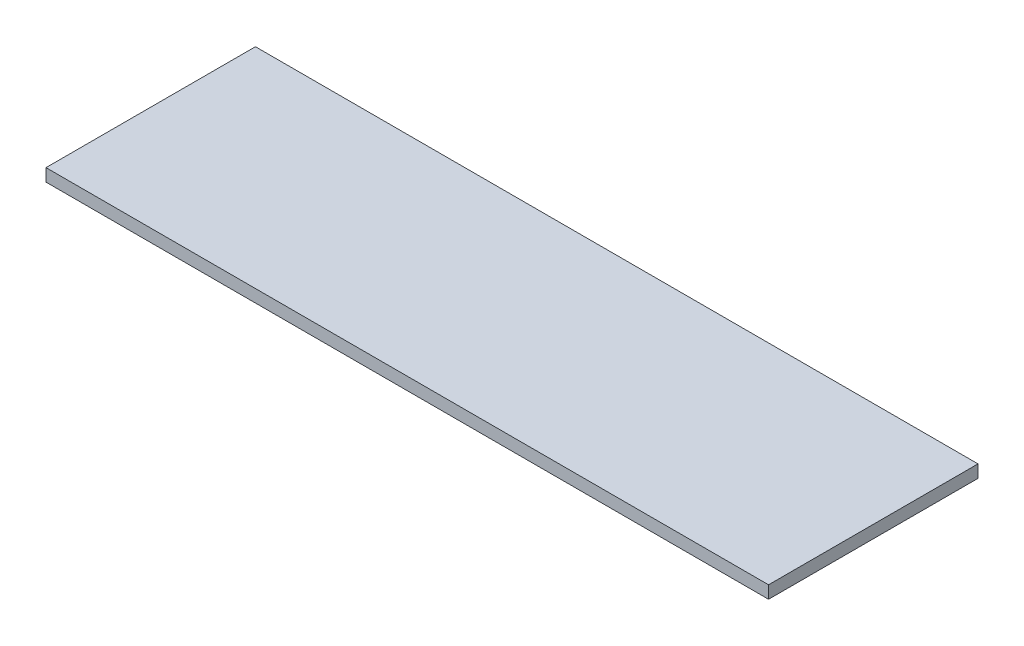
from build123d import *

# Parameters (mm, degrees)
SKETCH1_W           = 690
SKETCH1_H           = 200
BOSS_EXTRUDE1_DEPTH = 12


with BuildPart() as part:
    # Sketch1 → Boss-Extrude1 (new body)
    with BuildSketch(Plane(origin=(0, 0, 0), x_dir=(1, 0, 0), z_dir=(0, 1, 0))):
        Rectangle(SKETCH1_W, SKETCH1_H)
    extrude(amount=BOSS_EXTRUDE1_DEPTH)


solid = part.part
